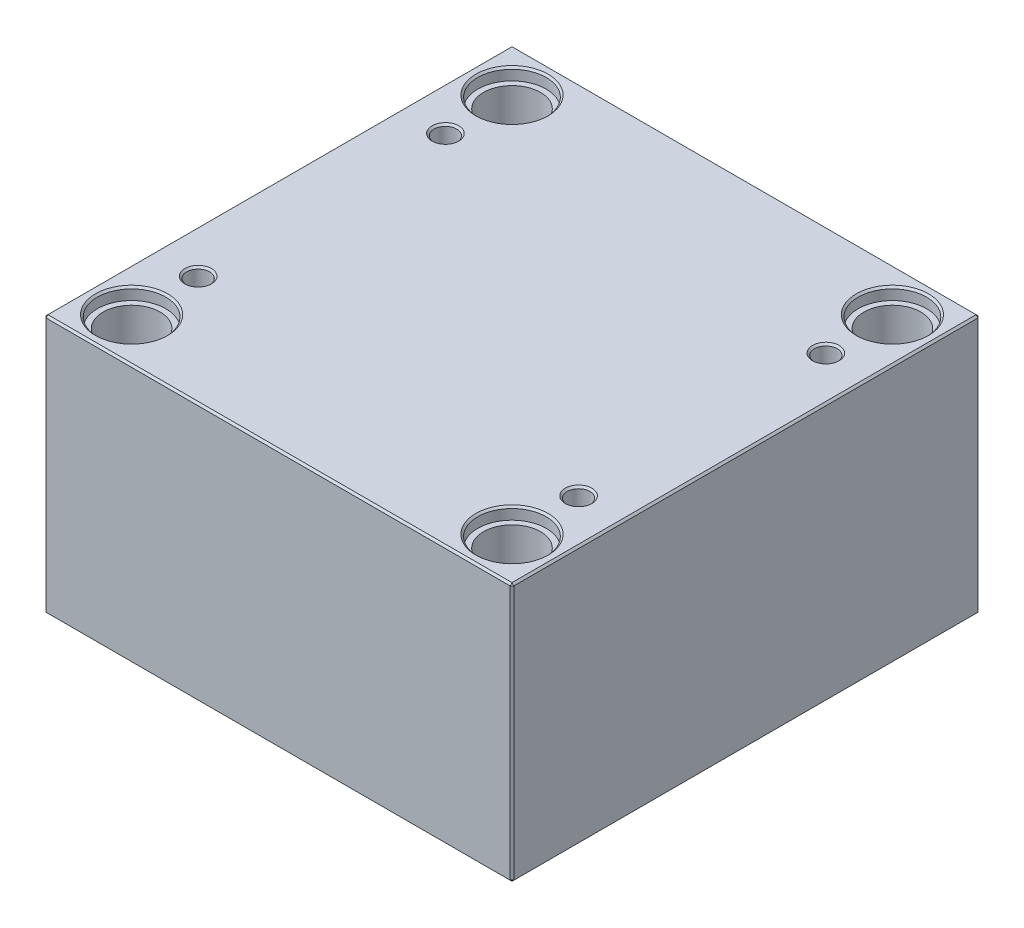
ISO-10303-21;
HEADER;
FILE_DESCRIPTION(('STEP AP214'),'2;1');
FILE_NAME('part.step','',(''),(''),'','','');
FILE_SCHEMA(('AUTOMOTIVE_DESIGN { 1 0 10303 214 1 1 1 1 }'));
ENDSEC;
DATA;
#1=APPLICATION_CONTEXT('core data for automotive mechanical design processes');
#2=APPLICATION_PROTOCOL_DEFINITION('international standard','automotive_design',2000,#1);
#3=PRODUCT_CONTEXT('',#1,'mechanical');
#4=PRODUCT('Part','Part','',(#3));
#5=PRODUCT_RELATED_PRODUCT_CATEGORY('part','',(#4));
#6=PRODUCT_DEFINITION_FORMATION('','',#4);
#7=PRODUCT_DEFINITION_CONTEXT('part definition',#1,'design');
#8=PRODUCT_DEFINITION('design','',#6,#7);
#9=PRODUCT_DEFINITION_SHAPE('','',#8);
#10=(LENGTH_UNIT() NAMED_UNIT(*) SI_UNIT(.MILLI.,.METRE.));
#11=(NAMED_UNIT(*) PLANE_ANGLE_UNIT() SI_UNIT($,.RADIAN.));
#12=(NAMED_UNIT(*) SI_UNIT($,.STERADIAN.) SOLID_ANGLE_UNIT());
#13=UNCERTAINTY_MEASURE_WITH_UNIT(LENGTH_MEASURE(1.E-05),#10,'distance_accuracy_value','');
#14=(GEOMETRIC_REPRESENTATION_CONTEXT(3) GLOBAL_UNCERTAINTY_ASSIGNED_CONTEXT((#13)) GLOBAL_UNIT_ASSIGNED_CONTEXT((#10,
#11,#12)) REPRESENTATION_CONTEXT('',''));
#15=CARTESIAN_POINT('',(0.,0.,0.));
#16=DIRECTION('',(0.,0.,1.));
#17=DIRECTION('',(1.,0.,0.));
#18=AXIS2_PLACEMENT_3D('',#15,#16,#17);
#19=CARTESIAN_POINT('',(-100.,0.,-100.));
#20=DIRECTION('',(0.,1.,0.));
#21=DIRECTION('',(0.,0.,1.));
#22=AXIS2_PLACEMENT_3D('',#19,#20,#21);
#23=CYLINDRICAL_SURFACE('',#22,15.);
#24=CARTESIAN_POINT('',(-100.,1.00000000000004,-100.));
#25=DIRECTION('',(0.,1.,0.));
#26=DIRECTION('',(0.,0.,1.));
#27=AXIS2_PLACEMENT_3D('',#24,#25,#26);
#28=CIRCLE('',#27,15.);
#29=CARTESIAN_POINT('',(-100.,1.00000000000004,-85.));
#30=VERTEX_POINT('',#29);
#31=EDGE_CURVE('E472',#30,#30,#28,.F.);
#32=ORIENTED_EDGE('',*,*,#31,.T.);
#33=EDGE_LOOP('',(#32));
#34=FACE_BOUND('',#33,.T.);
#35=CARTESIAN_POINT('',(-100.,129.7,-100.));
#36=DIRECTION('',(0.,1.,0.));
#37=DIRECTION('',(0.,0.,1.));
#38=AXIS2_PLACEMENT_3D('',#35,#36,#37);
#39=CIRCLE('',#38,15.);
#40=CARTESIAN_POINT('',(-100.,129.7,-85.));
#41=VERTEX_POINT('',#40);
#42=EDGE_CURVE('E221',#41,#41,#39,.F.);
#43=ORIENTED_EDGE('',*,*,#42,.F.);
#44=EDGE_LOOP('',(#43));
#45=FACE_BOUND('',#44,.T.);
#46=ADVANCED_FACE('F16',(#34,#45),#23,.F.);
#47=CARTESIAN_POINT('',(100.,0.,-100.));
#48=DIRECTION('',(0.,1.,0.));
#49=DIRECTION('',(0.,0.,1.));
#50=AXIS2_PLACEMENT_3D('',#47,#48,#49);
#51=CYLINDRICAL_SURFACE('',#50,15.);
#52=CARTESIAN_POINT('',(100.,1.00000000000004,-100.));
#53=DIRECTION('',(0.,1.,0.));
#54=DIRECTION('',(0.,0.,1.));
#55=AXIS2_PLACEMENT_3D('',#52,#53,#54);
#56=CIRCLE('',#55,15.);
#57=CARTESIAN_POINT('',(100.,1.00000000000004,-85.));
#58=VERTEX_POINT('',#57);
#59=EDGE_CURVE('E474',#58,#58,#56,.F.);
#60=ORIENTED_EDGE('',*,*,#59,.T.);
#61=EDGE_LOOP('',(#60));
#62=FACE_BOUND('',#61,.T.);
#63=CARTESIAN_POINT('',(100.,129.7,-100.));
#64=DIRECTION('',(0.,1.,0.));
#65=DIRECTION('',(0.,0.,1.));
#66=AXIS2_PLACEMENT_3D('',#63,#64,#65);
#67=CIRCLE('',#66,15.);
#68=CARTESIAN_POINT('',(100.,129.7,-85.));
#69=VERTEX_POINT('',#68);
#70=EDGE_CURVE('E218',#69,#69,#67,.F.);
#71=ORIENTED_EDGE('',*,*,#70,.F.);
#72=EDGE_LOOP('',(#71));
#73=FACE_BOUND('',#72,.T.);
#74=ADVANCED_FACE('F263',(#62,#73),#51,.F.);
#75=CARTESIAN_POINT('',(100.,0.,100.));
#76=DIRECTION('',(0.,1.,0.));
#77=DIRECTION('',(0.,0.,1.));
#78=AXIS2_PLACEMENT_3D('',#75,#76,#77);
#79=CYLINDRICAL_SURFACE('',#78,15.);
#80=CARTESIAN_POINT('',(100.,1.00000000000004,100.));
#81=DIRECTION('',(0.,1.,0.));
#82=DIRECTION('',(0.,0.,1.));
#83=AXIS2_PLACEMENT_3D('',#80,#81,#82);
#84=CIRCLE('',#83,15.);
#85=CARTESIAN_POINT('',(100.,1.00000000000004,115.));
#86=VERTEX_POINT('',#85);
#87=EDGE_CURVE('E477',#86,#86,#84,.F.);
#88=ORIENTED_EDGE('',*,*,#87,.T.);
#89=EDGE_LOOP('',(#88));
#90=FACE_BOUND('',#89,.T.);
#91=CARTESIAN_POINT('',(100.,129.7,100.));
#92=DIRECTION('',(0.,1.,0.));
#93=DIRECTION('',(0.,0.,1.));
#94=AXIS2_PLACEMENT_3D('',#91,#92,#93);
#95=CIRCLE('',#94,15.);
#96=CARTESIAN_POINT('',(100.,129.7,115.));
#97=VERTEX_POINT('',#96);
#98=EDGE_CURVE('E214',#97,#97,#95,.F.);
#99=ORIENTED_EDGE('',*,*,#98,.F.);
#100=EDGE_LOOP('',(#99));
#101=FACE_BOUND('',#100,.T.);
#102=ADVANCED_FACE('F270',(#90,#101),#79,.F.);
#103=CARTESIAN_POINT('',(-100.,0.,100.));
#104=DIRECTION('',(0.,1.,0.));
#105=DIRECTION('',(0.,0.,1.));
#106=AXIS2_PLACEMENT_3D('',#103,#104,#105);
#107=CYLINDRICAL_SURFACE('',#106,15.);
#108=CARTESIAN_POINT('',(-100.,1.00000000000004,100.));
#109=DIRECTION('',(0.,1.,0.));
#110=DIRECTION('',(0.,0.,1.));
#111=AXIS2_PLACEMENT_3D('',#108,#109,#110);
#112=CIRCLE('',#111,15.);
#113=CARTESIAN_POINT('',(-100.,1.00000000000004,115.));
#114=VERTEX_POINT('',#113);
#115=EDGE_CURVE('E480',#114,#114,#112,.F.);
#116=ORIENTED_EDGE('',*,*,#115,.T.);
#117=EDGE_LOOP('',(#116));
#118=FACE_BOUND('',#117,.T.);
#119=CARTESIAN_POINT('',(-100.,129.7,100.));
#120=DIRECTION('',(0.,1.,0.));
#121=DIRECTION('',(0.,0.,1.));
#122=AXIS2_PLACEMENT_3D('',#119,#120,#121);
#123=CIRCLE('',#122,15.);
#124=CARTESIAN_POINT('',(-100.,129.7,115.));
#125=VERTEX_POINT('',#124);
#126=EDGE_CURVE('E211',#125,#125,#123,.F.);
#127=ORIENTED_EDGE('',*,*,#126,.F.);
#128=EDGE_LOOP('',(#127));
#129=FACE_BOUND('',#128,.T.);
#130=ADVANCED_FACE('F277',(#118,#129),#107,.F.);
#131=CARTESIAN_POINT('',(-123.,136.,123.));
#132=DIRECTION('',(1.,0.,0.));
#133=DIRECTION('',(0.,0.,-1.));
#134=AXIS2_PLACEMENT_3D('',#131,#132,#133);
#135=PLANE('',#134);
#136=DIRECTION('',(0.,-1.,0.));
#137=VECTOR('',#136,1.);
#138=CARTESIAN_POINT('',(-123.,136.,-122.));
#139=LINE('',#138,#137);
#140=CARTESIAN_POINT('',(-123.,135.,-122.));
#141=VERTEX_POINT('',#140);
#142=CARTESIAN_POINT('',(-123.,1.,-122.));
#143=VERTEX_POINT('',#142);
#144=EDGE_CURVE('E487',#141,#143,#139,.T.);
#145=ORIENTED_EDGE('',*,*,#144,.T.);
#146=DIRECTION('',(0.,0.,1.));
#147=VECTOR('',#146,1.);
#148=CARTESIAN_POINT('',(-123.,1.,123.));
#149=LINE('',#148,#147);
#150=CARTESIAN_POINT('',(-123.,1.,122.));
#151=VERTEX_POINT('',#150);
#152=EDGE_CURVE('E490',#143,#151,#149,.T.);
#153=ORIENTED_EDGE('',*,*,#152,.T.);
#154=DIRECTION('',(0.,1.,0.));
#155=VECTOR('',#154,1.);
#156=CARTESIAN_POINT('',(-123.,136.,122.));
#157=LINE('',#156,#155);
#158=CARTESIAN_POINT('',(-123.,135.,122.));
#159=VERTEX_POINT('',#158);
#160=EDGE_CURVE('E485',#151,#159,#157,.T.);
#161=ORIENTED_EDGE('',*,*,#160,.T.);
#162=DIRECTION('',(0.,0.,-1.));
#163=VECTOR('',#162,1.);
#164=CARTESIAN_POINT('',(-123.,135.,-123.));
#165=LINE('',#164,#163);
#166=EDGE_CURVE('E483',#159,#141,#165,.T.);
#167=ORIENTED_EDGE('',*,*,#166,.T.);
#168=EDGE_LOOP('',(#145,#153,#161,#167));
#169=FACE_BOUND('',#168,.T.);
#170=ADVANCED_FACE('F298',(#169),#135,.F.);
#171=CARTESIAN_POINT('',(123.,136.,123.));
#172=DIRECTION('',(0.,0.,-1.));
#173=DIRECTION('',(-1.,0.,0.));
#174=AXIS2_PLACEMENT_3D('',#171,#172,#173);
#175=PLANE('',#174);
#176=DIRECTION('',(-1.,0.,0.));
#177=VECTOR('',#176,1.);
#178=CARTESIAN_POINT('',(-123.,135.,123.));
#179=LINE('',#178,#177);
#180=CARTESIAN_POINT('',(122.,135.,123.));
#181=VERTEX_POINT('',#180);
#182=CARTESIAN_POINT('',(-122.,135.,123.));
#183=VERTEX_POINT('',#182);
#184=EDGE_CURVE('E509',#181,#183,#179,.T.);
#185=ORIENTED_EDGE('',*,*,#184,.T.);
#186=DIRECTION('',(0.,-1.,0.));
#187=VECTOR('',#186,1.);
#188=CARTESIAN_POINT('',(-122.,136.,123.));
#189=LINE('',#188,#187);
#190=CARTESIAN_POINT('',(-122.,0.999999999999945,123.));
#191=VERTEX_POINT('',#190);
#192=EDGE_CURVE('E515',#183,#191,#189,.T.);
#193=ORIENTED_EDGE('',*,*,#192,.T.);
#194=DIRECTION('',(1.,0.,0.));
#195=VECTOR('',#194,1.);
#196=CARTESIAN_POINT('',(123.,0.999999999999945,123.));
#197=LINE('',#196,#195);
#198=CARTESIAN_POINT('',(122.,0.999999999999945,123.));
#199=VERTEX_POINT('',#198);
#200=EDGE_CURVE('E513',#191,#199,#197,.T.);
#201=ORIENTED_EDGE('',*,*,#200,.T.);
#202=DIRECTION('',(0.,1.,0.));
#203=VECTOR('',#202,1.);
#204=CARTESIAN_POINT('',(122.,136.,123.));
#205=LINE('',#204,#203);
#206=EDGE_CURVE('E511',#199,#181,#205,.T.);
#207=ORIENTED_EDGE('',*,*,#206,.T.);
#208=EDGE_LOOP('',(#185,#193,#201,#207));
#209=FACE_BOUND('',#208,.T.);
#210=ADVANCED_FACE('F294',(#209),#175,.F.);
#211=CARTESIAN_POINT('',(123.,136.,123.));
#212=DIRECTION('',(-1.,0.,0.));
#213=DIRECTION('',(0.,0.,1.));
#214=AXIS2_PLACEMENT_3D('',#211,#212,#213);
#215=PLANE('',#214);
#216=DIRECTION('',(0.,0.,-1.));
#217=VECTOR('',#216,1.);
#218=CARTESIAN_POINT('',(123.,0.999999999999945,123.));
#219=LINE('',#218,#217);
#220=CARTESIAN_POINT('',(123.,0.999999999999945,122.));
#221=VERTEX_POINT('',#220);
#222=CARTESIAN_POINT('',(123.,0.999999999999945,-122.));
#223=VERTEX_POINT('',#222);
#224=EDGE_CURVE('E504',#221,#223,#219,.T.);
#225=ORIENTED_EDGE('',*,*,#224,.T.);
#226=DIRECTION('',(0.,1.,0.));
#227=VECTOR('',#226,1.);
#228=CARTESIAN_POINT('',(123.,136.,-122.));
#229=LINE('',#228,#227);
#230=CARTESIAN_POINT('',(123.,135.,-122.));
#231=VERTEX_POINT('',#230);
#232=EDGE_CURVE('E506',#223,#231,#229,.T.);
#233=ORIENTED_EDGE('',*,*,#232,.T.);
#234=DIRECTION('',(0.,0.,1.));
#235=VECTOR('',#234,1.);
#236=CARTESIAN_POINT('',(123.,135.,123.));
#237=LINE('',#236,#235);
#238=CARTESIAN_POINT('',(123.,135.,122.));
#239=VERTEX_POINT('',#238);
#240=EDGE_CURVE('E500',#231,#239,#237,.T.);
#241=ORIENTED_EDGE('',*,*,#240,.T.);
#242=DIRECTION('',(0.,-1.,0.));
#243=VECTOR('',#242,1.);
#244=CARTESIAN_POINT('',(123.,136.,122.));
#245=LINE('',#244,#243);
#246=EDGE_CURVE('E502',#239,#221,#245,.T.);
#247=ORIENTED_EDGE('',*,*,#246,.T.);
#248=EDGE_LOOP('',(#225,#233,#241,#247));
#249=FACE_BOUND('',#248,.T.);
#250=ADVANCED_FACE('F290',(#249),#215,.F.);
#251=CARTESIAN_POINT('',(123.,136.,-123.));
#252=DIRECTION('',(0.,0.,1.));
#253=DIRECTION('',(1.,0.,0.));
#254=AXIS2_PLACEMENT_3D('',#251,#252,#253);
#255=PLANE('',#254);
#256=DIRECTION('',(0.,-1.,0.));
#257=VECTOR('',#256,1.);
#258=CARTESIAN_POINT('',(122.,136.,-123.));
#259=LINE('',#258,#257);
#260=CARTESIAN_POINT('',(122.,135.,-123.));
#261=VERTEX_POINT('',#260);
#262=CARTESIAN_POINT('',(122.,0.999999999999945,-123.));
#263=VERTEX_POINT('',#262);
#264=EDGE_CURVE('E494',#261,#263,#259,.T.);
#265=ORIENTED_EDGE('',*,*,#264,.T.);
#266=DIRECTION('',(-1.,0.,0.));
#267=VECTOR('',#266,1.);
#268=CARTESIAN_POINT('',(123.,0.999999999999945,-123.));
#269=LINE('',#268,#267);
#270=CARTESIAN_POINT('',(-122.,0.999999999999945,-123.));
#271=VERTEX_POINT('',#270);
#272=EDGE_CURVE('E138',#263,#271,#269,.T.);
#273=ORIENTED_EDGE('',*,*,#272,.T.);
#274=DIRECTION('',(0.,1.,0.));
#275=VECTOR('',#274,1.);
#276=CARTESIAN_POINT('',(-122.,136.,-123.));
#277=LINE('',#276,#275);
#278=CARTESIAN_POINT('',(-122.,135.,-123.));
#279=VERTEX_POINT('',#278);
#280=EDGE_CURVE('E496',#271,#279,#277,.T.);
#281=ORIENTED_EDGE('',*,*,#280,.T.);
#282=DIRECTION('',(1.,0.,0.));
#283=VECTOR('',#282,1.);
#284=CARTESIAN_POINT('',(123.,135.,-123.));
#285=LINE('',#284,#283);
#286=EDGE_CURVE('E492',#279,#261,#285,.T.);
#287=ORIENTED_EDGE('',*,*,#286,.T.);
#288=EDGE_LOOP('',(#265,#273,#281,#287));
#289=FACE_BOUND('',#288,.T.);
#290=ADVANCED_FACE('F282',(#289),#255,.F.);
#291=CARTESIAN_POINT('',(0.,136.,0.));
#292=DIRECTION('',(0.,1.,0.));
#293=DIRECTION('',(0.,0.,1.));
#294=AXIS2_PLACEMENT_3D('',#291,#292,#293);
#295=PLANE('',#294);
#296=CARTESIAN_POINT('',(100.,136.,100.));
#297=DIRECTION('',(0.,1.,0.));
#298=DIRECTION('',(0.,0.,1.));
#299=AXIS2_PLACEMENT_3D('',#296,#297,#298);
#300=CIRCLE('',#299,19.);
#301=CARTESIAN_POINT('',(100.,136.,119.));
#302=VERTEX_POINT('',#301);
#303=EDGE_CURVE('E236',#302,#302,#300,.F.);
#304=ORIENTED_EDGE('',*,*,#303,.T.);
#305=EDGE_LOOP('',(#304));
#306=FACE_BOUND('',#305,.T.);
#307=CARTESIAN_POINT('',(-100.,136.,100.));
#308=DIRECTION('',(0.,1.,0.));
#309=DIRECTION('',(0.,0.,1.));
#310=AXIS2_PLACEMENT_3D('',#307,#308,#309);
#311=CIRCLE('',#310,19.);
#312=CARTESIAN_POINT('',(-100.,136.,119.));
#313=VERTEX_POINT('',#312);
#314=EDGE_CURVE('E233',#313,#313,#311,.F.);
#315=ORIENTED_EDGE('',*,*,#314,.T.);
#316=EDGE_LOOP('',(#315));
#317=FACE_BOUND('',#316,.T.);
#318=CARTESIAN_POINT('',(100.,136.,-100.));
#319=DIRECTION('',(0.,1.,0.));
#320=DIRECTION('',(0.,0.,1.));
#321=AXIS2_PLACEMENT_3D('',#318,#319,#320);
#322=CIRCLE('',#321,19.);
#323=CARTESIAN_POINT('',(100.,136.,-81.));
#324=VERTEX_POINT('',#323);
#325=EDGE_CURVE('E230',#324,#324,#322,.F.);
#326=ORIENTED_EDGE('',*,*,#325,.T.);
#327=EDGE_LOOP('',(#326));
#328=FACE_BOUND('',#327,.T.);
#329=CARTESIAN_POINT('',(-100.,136.,-100.));
#330=DIRECTION('',(0.,1.,0.));
#331=DIRECTION('',(0.,0.,1.));
#332=AXIS2_PLACEMENT_3D('',#329,#330,#331);
#333=CIRCLE('',#332,19.);
#334=CARTESIAN_POINT('',(-100.,136.,-81.));
#335=VERTEX_POINT('',#334);
#336=EDGE_CURVE('E227',#335,#335,#333,.F.);
#337=ORIENTED_EDGE('',*,*,#336,.T.);
#338=EDGE_LOOP('',(#337));
#339=FACE_BOUND('',#338,.T.);
#340=CARTESIAN_POINT('',(-100.,136.,65.));
#341=DIRECTION('',(0.,1.,0.));
#342=DIRECTION('',(0.,0.,1.));
#343=AXIS2_PLACEMENT_3D('',#340,#341,#342);
#344=CIRCLE('',#343,7.);
#345=CARTESIAN_POINT('',(-100.,136.,72.));
#346=VERTEX_POINT('',#345);
#347=EDGE_CURVE('E198',#346,#346,#344,.F.);
#348=ORIENTED_EDGE('',*,*,#347,.T.);
#349=EDGE_LOOP('',(#348));
#350=FACE_BOUND('',#349,.T.);
#351=CARTESIAN_POINT('',(100.,136.,65.));
#352=DIRECTION('',(0.,1.,0.));
#353=DIRECTION('',(0.,0.,1.));
#354=AXIS2_PLACEMENT_3D('',#351,#352,#353);
#355=CIRCLE('',#354,7.);
#356=CARTESIAN_POINT('',(100.,136.,72.));
#357=VERTEX_POINT('',#356);
#358=EDGE_CURVE('E195',#357,#357,#355,.F.);
#359=ORIENTED_EDGE('',*,*,#358,.T.);
#360=EDGE_LOOP('',(#359));
#361=FACE_BOUND('',#360,.T.);
#362=CARTESIAN_POINT('',(100.,136.,-65.));
#363=DIRECTION('',(0.,1.,0.));
#364=DIRECTION('',(0.,0.,1.));
#365=AXIS2_PLACEMENT_3D('',#362,#363,#364);
#366=CIRCLE('',#365,7.);
#367=CARTESIAN_POINT('',(100.,136.,-58.));
#368=VERTEX_POINT('',#367);
#369=EDGE_CURVE('E192',#368,#368,#366,.F.);
#370=ORIENTED_EDGE('',*,*,#369,.T.);
#371=EDGE_LOOP('',(#370));
#372=FACE_BOUND('',#371,.T.);
#373=CARTESIAN_POINT('',(-100.,136.,-65.));
#374=DIRECTION('',(0.,1.,0.));
#375=DIRECTION('',(0.,0.,1.));
#376=AXIS2_PLACEMENT_3D('',#373,#374,#375);
#377=CIRCLE('',#376,7.);
#378=CARTESIAN_POINT('',(-100.,136.,-58.));
#379=VERTEX_POINT('',#378);
#380=EDGE_CURVE('E188',#379,#379,#377,.F.);
#381=ORIENTED_EDGE('',*,*,#380,.T.);
#382=EDGE_LOOP('',(#381));
#383=FACE_BOUND('',#382,.T.);
#384=DIRECTION('',(0.,0.,-1.));
#385=VECTOR('',#384,1.);
#386=CARTESIAN_POINT('',(122.,136.,-123.));
#387=LINE('',#386,#385);
#388=CARTESIAN_POINT('',(122.,136.,122.));
#389=VERTEX_POINT('',#388);
#390=CARTESIAN_POINT('',(122.,136.,-122.));
#391=VERTEX_POINT('',#390);
#392=EDGE_CURVE('E31',#389,#391,#387,.T.);
#393=ORIENTED_EDGE('',*,*,#392,.T.);
#394=DIRECTION('',(-1.,0.,0.));
#395=VECTOR('',#394,1.);
#396=CARTESIAN_POINT('',(-123.,136.,-122.));
#397=LINE('',#396,#395);
#398=CARTESIAN_POINT('',(-122.,136.,-122.));
#399=VERTEX_POINT('',#398);
#400=EDGE_CURVE('E189',#391,#399,#397,.T.);
#401=ORIENTED_EDGE('',*,*,#400,.T.);
#402=DIRECTION('',(0.,0.,1.));
#403=VECTOR('',#402,1.);
#404=CARTESIAN_POINT('',(-122.,136.,123.));
#405=LINE('',#404,#403);
#406=CARTESIAN_POINT('',(-122.,136.,122.));
#407=VERTEX_POINT('',#406);
#408=EDGE_CURVE('E518',#399,#407,#405,.T.);
#409=ORIENTED_EDGE('',*,*,#408,.T.);
#410=DIRECTION('',(1.,0.,0.));
#411=VECTOR('',#410,1.);
#412=CARTESIAN_POINT('',(123.,136.,122.));
#413=LINE('',#412,#411);
#414=EDGE_CURVE('E36',#407,#389,#413,.T.);
#415=ORIENTED_EDGE('',*,*,#414,.T.);
#416=EDGE_LOOP('',(#393,#401,#409,#415));
#417=FACE_BOUND('',#416,.T.);
#418=ADVANCED_FACE('F279',(#306,#317,#328,#339,#350,#361,#372,#383,#417),#295,.T.);
#419=CARTESIAN_POINT('',(0.,0.,0.));
#420=DIRECTION('',(0.,1.,0.));
#421=DIRECTION('',(0.,0.,1.));
#422=AXIS2_PLACEMENT_3D('',#419,#420,#421);
#423=PLANE('',#422);
#424=CARTESIAN_POINT('',(-100.,0.,-100.));
#425=DIRECTION('',(0.,1.,0.));
#426=DIRECTION('',(0.,0.,1.));
#427=AXIS2_PLACEMENT_3D('',#424,#425,#426);
#428=CIRCLE('',#427,16.);
#429=CARTESIAN_POINT('',(-100.,0.,-84.));
#430=VERTEX_POINT('',#429);
#431=EDGE_CURVE('E469',#430,#430,#428,.T.);
#432=ORIENTED_EDGE('',*,*,#431,.T.);
#433=EDGE_LOOP('',(#432));
#434=FACE_BOUND('',#433,.T.);
#435=CARTESIAN_POINT('',(100.,0.,-100.));
#436=DIRECTION('',(0.,1.,0.));
#437=DIRECTION('',(0.,0.,1.));
#438=AXIS2_PLACEMENT_3D('',#435,#436,#437);
#439=CIRCLE('',#438,16.);
#440=CARTESIAN_POINT('',(100.,0.,-84.));
#441=VERTEX_POINT('',#440);
#442=EDGE_CURVE('E466',#441,#441,#439,.T.);
#443=ORIENTED_EDGE('',*,*,#442,.T.);
#444=EDGE_LOOP('',(#443));
#445=FACE_BOUND('',#444,.T.);
#446=CARTESIAN_POINT('',(100.,0.,100.));
#447=DIRECTION('',(0.,1.,0.));
#448=DIRECTION('',(0.,0.,1.));
#449=AXIS2_PLACEMENT_3D('',#446,#447,#448);
#450=CIRCLE('',#449,16.);
#451=CARTESIAN_POINT('',(100.,0.,116.));
#452=VERTEX_POINT('',#451);
#453=EDGE_CURVE('E463',#452,#452,#450,.T.);
#454=ORIENTED_EDGE('',*,*,#453,.T.);
#455=EDGE_LOOP('',(#454));
#456=FACE_BOUND('',#455,.T.);
#457=CARTESIAN_POINT('',(-100.,0.,100.));
#458=DIRECTION('',(0.,1.,0.));
#459=DIRECTION('',(0.,0.,1.));
#460=AXIS2_PLACEMENT_3D('',#457,#458,#459);
#461=CIRCLE('',#460,16.);
#462=CARTESIAN_POINT('',(-100.,0.,116.));
#463=VERTEX_POINT('',#462);
#464=EDGE_CURVE('E460',#463,#463,#461,.T.);
#465=ORIENTED_EDGE('',*,*,#464,.T.);
#466=EDGE_LOOP('',(#465));
#467=FACE_BOUND('',#466,.T.);
#468=DIRECTION('',(0.,0.,1.));
#469=VECTOR('',#468,1.);
#470=CARTESIAN_POINT('',(122.,0.,0.));
#471=LINE('',#470,#469);
#472=CARTESIAN_POINT('',(122.,0.,-122.));
#473=VERTEX_POINT('',#472);
#474=CARTESIAN_POINT('',(122.,0.,122.));
#475=VERTEX_POINT('',#474);
#476=EDGE_CURVE('E108',#473,#475,#471,.T.);
#477=ORIENTED_EDGE('',*,*,#476,.T.);
#478=DIRECTION('',(-1.,0.,0.));
#479=VECTOR('',#478,1.);
#480=CARTESIAN_POINT('',(0.,0.,122.));
#481=LINE('',#480,#479);
#482=CARTESIAN_POINT('',(-122.,0.,122.));
#483=VERTEX_POINT('',#482);
#484=EDGE_CURVE('E458',#475,#483,#481,.T.);
#485=ORIENTED_EDGE('',*,*,#484,.T.);
#486=DIRECTION('',(0.,0.,-1.));
#487=VECTOR('',#486,1.);
#488=CARTESIAN_POINT('',(-122.,0.,0.));
#489=LINE('',#488,#487);
#490=CARTESIAN_POINT('',(-122.,0.,-122.));
#491=VERTEX_POINT('',#490);
#492=EDGE_CURVE('E110',#483,#491,#489,.T.);
#493=ORIENTED_EDGE('',*,*,#492,.T.);
#494=DIRECTION('',(1.,0.,0.));
#495=VECTOR('',#494,1.);
#496=CARTESIAN_POINT('',(0.,0.,-122.));
#497=LINE('',#496,#495);
#498=EDGE_CURVE('E104',#491,#473,#497,.T.);
#499=ORIENTED_EDGE('',*,*,#498,.T.);
#500=EDGE_LOOP('',(#477,#485,#493,#499));
#501=FACE_BOUND('',#500,.T.);
#502=ADVANCED_FACE('F106',(#434,#445,#456,#467,#501),#423,.F.);
#503=CARTESIAN_POINT('',(-100.,0.,-100.));
#504=DIRECTION('',(0.,-1.,0.));
#505=DIRECTION('',(0.,0.,-1.));
#506=AXIS2_PLACEMENT_3D('',#503,#504,#505);
#507=CONICAL_SURFACE('',#506,16.,0.785398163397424);
#508=ORIENTED_EDGE('',*,*,#31,.F.);
#509=EDGE_LOOP('',(#508));
#510=FACE_BOUND('',#509,.T.);
#511=ORIENTED_EDGE('',*,*,#431,.F.);
#512=EDGE_LOOP('',(#511));
#513=FACE_BOUND('',#512,.T.);
#514=ADVANCED_FACE('F286',(#510,#513),#507,.F.);
#515=CARTESIAN_POINT('',(100.,0.,-100.));
#516=DIRECTION('',(0.,-1.,0.));
#517=DIRECTION('',(0.,0.,-1.));
#518=AXIS2_PLACEMENT_3D('',#515,#516,#517);
#519=CONICAL_SURFACE('',#518,16.,0.785398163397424);
#520=ORIENTED_EDGE('',*,*,#59,.F.);
#521=EDGE_LOOP('',(#520));
#522=FACE_BOUND('',#521,.T.);
#523=ORIENTED_EDGE('',*,*,#442,.F.);
#524=EDGE_LOOP('',(#523));
#525=FACE_BOUND('',#524,.T.);
#526=ADVANCED_FACE('F305',(#522,#525),#519,.F.);
#527=CARTESIAN_POINT('',(100.,0.,100.));
#528=DIRECTION('',(0.,-1.,0.));
#529=DIRECTION('',(0.,0.,-1.));
#530=AXIS2_PLACEMENT_3D('',#527,#528,#529);
#531=CONICAL_SURFACE('',#530,16.,0.785398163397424);
#532=ORIENTED_EDGE('',*,*,#87,.F.);
#533=EDGE_LOOP('',(#532));
#534=FACE_BOUND('',#533,.T.);
#535=ORIENTED_EDGE('',*,*,#453,.F.);
#536=EDGE_LOOP('',(#535));
#537=FACE_BOUND('',#536,.T.);
#538=ADVANCED_FACE('F309',(#534,#537),#531,.F.);
#539=CARTESIAN_POINT('',(-100.,0.,100.));
#540=DIRECTION('',(0.,-1.,0.));
#541=DIRECTION('',(0.,0.,-1.));
#542=AXIS2_PLACEMENT_3D('',#539,#540,#541);
#543=CONICAL_SURFACE('',#542,16.,0.785398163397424);
#544=ORIENTED_EDGE('',*,*,#115,.F.);
#545=EDGE_LOOP('',(#544));
#546=FACE_BOUND('',#545,.T.);
#547=ORIENTED_EDGE('',*,*,#464,.F.);
#548=EDGE_LOOP('',(#547));
#549=FACE_BOUND('',#548,.T.);
#550=ADVANCED_FACE('F313',(#546,#549),#543,.F.);
#551=CARTESIAN_POINT('',(123.,136.,122.));
#552=DIRECTION('',(-0.707106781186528,0.,-0.707106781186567));
#553=DIRECTION('',(0.,-1.,0.));
#554=AXIS2_PLACEMENT_3D('',#551,#552,#553);
#555=PLANE('',#554);
#556=DIRECTION('',(-0.707106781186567,0.,0.707106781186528));
#557=VECTOR('',#556,1.);
#558=CARTESIAN_POINT('',(122.,135.,123.));
#559=LINE('',#558,#557);
#560=EDGE_CURVE('E126',#181,#239,#559,.F.);
#561=ORIENTED_EDGE('',*,*,#560,.F.);
#562=ORIENTED_EDGE('',*,*,#206,.F.);
#563=DIRECTION('',(0.707106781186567,0.,-0.707106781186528));
#564=VECTOR('',#563,1.);
#565=CARTESIAN_POINT('',(122.,0.999999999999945,123.));
#566=LINE('',#565,#564);
#567=EDGE_CURVE('E180',#221,#199,#566,.F.);
#568=ORIENTED_EDGE('',*,*,#567,.F.);
#569=ORIENTED_EDGE('',*,*,#246,.F.);
#570=EDGE_LOOP('',(#561,#562,#568,#569));
#571=FACE_BOUND('',#570,.T.);
#572=ADVANCED_FACE('F317',(#571),#555,.F.);
#573=CARTESIAN_POINT('',(122.,135.,123.));
#574=DIRECTION('',(0.577350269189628,0.577350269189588,0.577350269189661));
#575=DIRECTION('',(0.707106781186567,0.,-0.707106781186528));
#576=AXIS2_PLACEMENT_3D('',#573,#574,#575);
#577=PLANE('',#576);
#578=DIRECTION('',(0.,-0.70710678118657,0.707106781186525));
#579=VECTOR('',#578,1.);
#580=CARTESIAN_POINT('',(122.,135.,123.));
#581=LINE('',#580,#579);
#582=EDGE_CURVE('E175',#181,#389,#581,.F.);
#583=ORIENTED_EDGE('',*,*,#582,.F.);
#584=ORIENTED_EDGE('',*,*,#560,.T.);
#585=DIRECTION('',(-0.707106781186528,0.707106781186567,0.));
#586=VECTOR('',#585,1.);
#587=CARTESIAN_POINT('',(122.5,135.5,122.));
#588=LINE('',#587,#586);
#589=EDGE_CURVE('E177',#389,#239,#588,.F.);
#590=ORIENTED_EDGE('',*,*,#589,.F.);
#591=EDGE_LOOP('',(#583,#584,#590));
#592=FACE_BOUND('',#591,.T.);
#593=ADVANCED_FACE('F385',(#592),#577,.T.);
#594=CARTESIAN_POINT('',(122.,0.999999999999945,123.));
#595=DIRECTION('',(0.577350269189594,-0.577350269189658,0.577350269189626));
#596=DIRECTION('',(0.,-0.707106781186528,-0.707106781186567));
#597=AXIS2_PLACEMENT_3D('',#594,#595,#596);
#598=PLANE('',#597);
#599=DIRECTION('',(-0.707106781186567,-0.707106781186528,0.));
#600=VECTOR('',#599,1.);
#601=CARTESIAN_POINT('',(122.5,0.499999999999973,122.));
#602=LINE('',#601,#600);
#603=EDGE_CURVE('E124',#221,#475,#602,.T.);
#604=ORIENTED_EDGE('',*,*,#603,.F.);
#605=ORIENTED_EDGE('',*,*,#567,.T.);
#606=DIRECTION('',(0.,0.70710678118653,0.707106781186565));
#607=VECTOR('',#606,1.);
#608=CARTESIAN_POINT('',(122.,0.999999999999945,123.));
#609=LINE('',#608,#607);
#610=EDGE_CURVE('E172',#475,#199,#609,.T.);
#611=ORIENTED_EDGE('',*,*,#610,.F.);
#612=EDGE_LOOP('',(#604,#605,#611));
#613=FACE_BOUND('',#612,.T.);
#614=ADVANCED_FACE('F381',(#613),#598,.T.);
#615=CARTESIAN_POINT('',(122.,136.,0.));
#616=DIRECTION('',(0.707106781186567,0.707106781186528,0.));
#617=DIRECTION('',(0.,0.,1.));
#618=AXIS2_PLACEMENT_3D('',#615,#616,#617);
#619=PLANE('',#618);
#620=ORIENTED_EDGE('',*,*,#589,.T.);
#621=ORIENTED_EDGE('',*,*,#240,.F.);
#622=DIRECTION('',(0.707106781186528,-0.707106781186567,0.));
#623=VECTOR('',#622,1.);
#624=CARTESIAN_POINT('',(123.,135.,-122.));
#625=LINE('',#624,#623);
#626=EDGE_CURVE('E166',#391,#231,#625,.T.);
#627=ORIENTED_EDGE('',*,*,#626,.F.);
#628=ORIENTED_EDGE('',*,*,#392,.F.);
#629=EDGE_LOOP('',(#620,#621,#627,#628));
#630=FACE_BOUND('',#629,.T.);
#631=ADVANCED_FACE('F377',(#630),#619,.T.);
#632=CARTESIAN_POINT('',(0.,136.,122.));
#633=DIRECTION('',(0.,0.707106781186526,0.70710678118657));
#634=DIRECTION('',(-1.,0.,0.));
#635=AXIS2_PLACEMENT_3D('',#632,#633,#634);
#636=PLANE('',#635);
#637=ORIENTED_EDGE('',*,*,#582,.T.);
#638=ORIENTED_EDGE('',*,*,#414,.F.);
#639=DIRECTION('',(0.,0.70710678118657,-0.707106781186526));
#640=VECTOR('',#639,1.);
#641=CARTESIAN_POINT('',(-122.,135.5,122.5));
#642=LINE('',#641,#640);
#643=EDGE_CURVE('E163',#183,#407,#642,.T.);
#644=ORIENTED_EDGE('',*,*,#643,.F.);
#645=ORIENTED_EDGE('',*,*,#184,.F.);
#646=EDGE_LOOP('',(#637,#638,#644,#645));
#647=FACE_BOUND('',#646,.T.);
#648=ADVANCED_FACE('F373',(#647),#636,.T.);
#649=CARTESIAN_POINT('',(-122.,136.,123.));
#650=DIRECTION('',(0.707106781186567,0.,-0.707106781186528));
#651=DIRECTION('',(0.,-1.,0.));
#652=AXIS2_PLACEMENT_3D('',#649,#650,#651);
#653=PLANE('',#652);
#654=DIRECTION('',(0.707106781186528,0.,0.707106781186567));
#655=VECTOR('',#654,1.);
#656=CARTESIAN_POINT('',(-122.,0.999999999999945,123.));
#657=LINE('',#656,#655);
#658=EDGE_CURVE('E157',#191,#151,#657,.F.);
#659=ORIENTED_EDGE('',*,*,#658,.F.);
#660=ORIENTED_EDGE('',*,*,#192,.F.);
#661=DIRECTION('',(-0.707106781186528,0.,-0.707106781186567));
#662=VECTOR('',#661,1.);
#663=CARTESIAN_POINT('',(-123.,135.,122.));
#664=LINE('',#663,#662);
#665=EDGE_CURVE('E160',#159,#183,#664,.F.);
#666=ORIENTED_EDGE('',*,*,#665,.F.);
#667=ORIENTED_EDGE('',*,*,#160,.F.);
#668=EDGE_LOOP('',(#659,#660,#666,#667));
#669=FACE_BOUND('',#668,.T.);
#670=ADVANCED_FACE('F369',(#669),#653,.F.);
#671=CARTESIAN_POINT('',(123.,0.999999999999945,123.));
#672=DIRECTION('',(0.,0.707106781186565,-0.70710678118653));
#673=DIRECTION('',(1.,0.,0.));
#674=AXIS2_PLACEMENT_3D('',#671,#672,#673);
#675=PLANE('',#674);
#676=ORIENTED_EDGE('',*,*,#610,.T.);
#677=ORIENTED_EDGE('',*,*,#200,.F.);
#678=DIRECTION('',(0.,-0.70710678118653,-0.707106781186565));
#679=VECTOR('',#678,1.);
#680=CARTESIAN_POINT('',(-122.,0.999999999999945,123.));
#681=LINE('',#680,#679);
#682=EDGE_CURVE('E135',#483,#191,#681,.F.);
#683=ORIENTED_EDGE('',*,*,#682,.F.);
#684=ORIENTED_EDGE('',*,*,#484,.F.);
#685=EDGE_LOOP('',(#676,#677,#683,#684));
#686=FACE_BOUND('',#685,.T.);
#687=ADVANCED_FACE('F366',(#686),#675,.F.);
#688=CARTESIAN_POINT('',(123.,0.999999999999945,123.));
#689=DIRECTION('',(-0.707106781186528,0.707106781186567,0.));
#690=DIRECTION('',(0.,0.,-1.));
#691=AXIS2_PLACEMENT_3D('',#688,#689,#690);
#692=PLANE('',#691);
#693=ORIENTED_EDGE('',*,*,#603,.T.);
#694=ORIENTED_EDGE('',*,*,#476,.F.);
#695=DIRECTION('',(0.707106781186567,0.707106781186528,0.));
#696=VECTOR('',#695,1.);
#697=CARTESIAN_POINT('',(122.5,0.499999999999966,-122.));
#698=LINE('',#697,#696);
#699=EDGE_CURVE('E121',#223,#473,#698,.F.);
#700=ORIENTED_EDGE('',*,*,#699,.F.);
#701=ORIENTED_EDGE('',*,*,#224,.F.);
#702=EDGE_LOOP('',(#693,#694,#700,#701));
#703=FACE_BOUND('',#702,.T.);
#704=ADVANCED_FACE('F119',(#703),#692,.F.);
#705=CARTESIAN_POINT('',(122.,136.,-123.));
#706=DIRECTION('',(-0.707106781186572,0.,0.707106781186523));
#707=DIRECTION('',(0.,-1.,0.));
#708=AXIS2_PLACEMENT_3D('',#705,#706,#707);
#709=PLANE('',#708);
#710=DIRECTION('',(0.707106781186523,0.,0.707106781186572));
#711=VECTOR('',#710,1.);
#712=CARTESIAN_POINT('',(123.,135.,-122.));
#713=LINE('',#712,#711);
#714=EDGE_CURVE('E168',#231,#261,#713,.F.);
#715=ORIENTED_EDGE('',*,*,#714,.F.);
#716=ORIENTED_EDGE('',*,*,#232,.F.);
#717=DIRECTION('',(-0.707106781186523,0.,-0.707106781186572));
#718=VECTOR('',#717,1.);
#719=CARTESIAN_POINT('',(122.,0.999999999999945,-123.));
#720=LINE('',#719,#718);
#721=EDGE_CURVE('E134',#263,#223,#720,.F.);
#722=ORIENTED_EDGE('',*,*,#721,.F.);
#723=ORIENTED_EDGE('',*,*,#264,.F.);
#724=EDGE_LOOP('',(#715,#716,#722,#723));
#725=FACE_BOUND('',#724,.T.);
#726=ADVANCED_FACE('F359',(#725),#709,.F.);
#727=CARTESIAN_POINT('',(123.,135.,-122.));
#728=DIRECTION('',(0.577350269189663,0.577350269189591,-0.577350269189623));
#729=DIRECTION('',(-0.707106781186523,0.,-0.707106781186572));
#730=AXIS2_PLACEMENT_3D('',#727,#728,#729);
#731=PLANE('',#730);
#732=ORIENTED_EDGE('',*,*,#626,.T.);
#733=ORIENTED_EDGE('',*,*,#714,.T.);
#734=DIRECTION('',(0.,0.707106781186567,0.707106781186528));
#735=VECTOR('',#734,1.);
#736=CARTESIAN_POINT('',(122.,135.5,-122.5));
#737=LINE('',#736,#735);
#738=EDGE_CURVE('E152',#391,#261,#737,.F.);
#739=ORIENTED_EDGE('',*,*,#738,.F.);
#740=EDGE_LOOP('',(#732,#733,#739));
#741=FACE_BOUND('',#740,.T.);
#742=ADVANCED_FACE('F355',(#741),#731,.T.);
#743=CARTESIAN_POINT('',(-123.,135.,122.));
#744=DIRECTION('',(-0.577350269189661,0.577350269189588,0.577350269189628));
#745=DIRECTION('',(0.707106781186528,0.,0.707106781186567));
#746=AXIS2_PLACEMENT_3D('',#743,#744,#745);
#747=PLANE('',#746);
#748=ORIENTED_EDGE('',*,*,#665,.T.);
#749=ORIENTED_EDGE('',*,*,#643,.T.);
#750=DIRECTION('',(-0.707106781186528,-0.707106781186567,0.));
#751=VECTOR('',#750,1.);
#752=CARTESIAN_POINT('',(-123.,135.,122.));
#753=LINE('',#752,#751);
#754=EDGE_CURVE('E143',#159,#407,#753,.F.);
#755=ORIENTED_EDGE('',*,*,#754,.F.);
#756=EDGE_LOOP('',(#748,#749,#755));
#757=FACE_BOUND('',#756,.T.);
#758=ADVANCED_FACE('F351',(#757),#747,.T.);
#759=CARTESIAN_POINT('',(-122.,0.999999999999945,123.));
#760=DIRECTION('',(-0.577350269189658,-0.577350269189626,0.577350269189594));
#761=DIRECTION('',(0.707106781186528,-0.707106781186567,0.));
#762=AXIS2_PLACEMENT_3D('',#759,#760,#761);
#763=PLANE('',#762);
#764=ORIENTED_EDGE('',*,*,#682,.T.);
#765=ORIENTED_EDGE('',*,*,#658,.T.);
#766=DIRECTION('',(-0.707106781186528,0.707106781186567,0.));
#767=VECTOR('',#766,1.);
#768=CARTESIAN_POINT('',(-122.5,0.5,122.));
#769=LINE('',#768,#767);
#770=EDGE_CURVE('E139',#483,#151,#769,.T.);
#771=ORIENTED_EDGE('',*,*,#770,.F.);
#772=EDGE_LOOP('',(#764,#765,#771));
#773=FACE_BOUND('',#772,.T.);
#774=ADVANCED_FACE('F348',(#773),#763,.T.);
#775=CARTESIAN_POINT('',(122.,0.999999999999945,-123.));
#776=DIRECTION('',(0.577350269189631,-0.577350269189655,-0.577350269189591));
#777=DIRECTION('',(0.707106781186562,0.707106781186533,0.));
#778=AXIS2_PLACEMENT_3D('',#775,#776,#777);
#779=PLANE('',#778);
#780=ORIENTED_EDGE('',*,*,#721,.T.);
#781=ORIENTED_EDGE('',*,*,#699,.T.);
#782=DIRECTION('',(0.,-0.707106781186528,0.707106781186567));
#783=VECTOR('',#782,1.);
#784=CARTESIAN_POINT('',(122.,0.999999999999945,-123.));
#785=LINE('',#784,#783);
#786=EDGE_CURVE('E131',#263,#473,#785,.T.);
#787=ORIENTED_EDGE('',*,*,#786,.F.);
#788=EDGE_LOOP('',(#780,#781,#787));
#789=FACE_BOUND('',#788,.T.);
#790=ADVANCED_FACE('F130',(#789),#779,.T.);
#791=CARTESIAN_POINT('',(0.,136.,-122.));
#792=DIRECTION('',(0.,0.707106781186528,-0.707106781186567));
#793=DIRECTION('',(1.,0.,0.));
#794=AXIS2_PLACEMENT_3D('',#791,#792,#793);
#795=PLANE('',#794);
#796=ORIENTED_EDGE('',*,*,#738,.T.);
#797=ORIENTED_EDGE('',*,*,#286,.F.);
#798=DIRECTION('',(0.,-0.707106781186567,-0.707106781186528));
#799=VECTOR('',#798,1.);
#800=CARTESIAN_POINT('',(-122.,135.,-123.));
#801=LINE('',#800,#799);
#802=EDGE_CURVE('E140',#399,#279,#801,.T.);
#803=ORIENTED_EDGE('',*,*,#802,.F.);
#804=ORIENTED_EDGE('',*,*,#400,.F.);
#805=EDGE_LOOP('',(#796,#797,#803,#804));
#806=FACE_BOUND('',#805,.T.);
#807=ADVANCED_FACE('F341',(#806),#795,.T.);
#808=CARTESIAN_POINT('',(-122.,136.,0.));
#809=DIRECTION('',(-0.707106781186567,0.707106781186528,0.));
#810=DIRECTION('',(0.,0.,-1.));
#811=AXIS2_PLACEMENT_3D('',#808,#809,#810);
#812=PLANE('',#811);
#813=ORIENTED_EDGE('',*,*,#754,.T.);
#814=ORIENTED_EDGE('',*,*,#408,.F.);
#815=DIRECTION('',(0.707106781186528,0.707106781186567,0.));
#816=VECTOR('',#815,1.);
#817=CARTESIAN_POINT('',(-122.5,135.5,-122.));
#818=LINE('',#817,#816);
#819=EDGE_CURVE('E146',#141,#399,#818,.T.);
#820=ORIENTED_EDGE('',*,*,#819,.F.);
#821=ORIENTED_EDGE('',*,*,#166,.F.);
#822=EDGE_LOOP('',(#813,#814,#820,#821));
#823=FACE_BOUND('',#822,.T.);
#824=ADVANCED_FACE('F337',(#823),#812,.T.);
#825=CARTESIAN_POINT('',(-123.,1.,123.));
#826=DIRECTION('',(0.707106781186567,0.707106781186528,0.));
#827=DIRECTION('',(0.,0.,1.));
#828=AXIS2_PLACEMENT_3D('',#825,#826,#827);
#829=PLANE('',#828);
#830=ORIENTED_EDGE('',*,*,#770,.T.);
#831=ORIENTED_EDGE('',*,*,#152,.F.);
#832=DIRECTION('',(0.707106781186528,-0.707106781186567,0.));
#833=VECTOR('',#832,1.);
#834=CARTESIAN_POINT('',(-123.,1.,-122.));
#835=LINE('',#834,#833);
#836=EDGE_CURVE('E529',#491,#143,#835,.F.);
#837=ORIENTED_EDGE('',*,*,#836,.F.);
#838=ORIENTED_EDGE('',*,*,#492,.F.);
#839=EDGE_LOOP('',(#830,#831,#837,#838));
#840=FACE_BOUND('',#839,.T.);
#841=ADVANCED_FACE('F334',(#840),#829,.F.);
#842=CARTESIAN_POINT('',(123.,0.999999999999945,-123.));
#843=DIRECTION('',(0.,0.707106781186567,0.707106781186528));
#844=DIRECTION('',(-1.,0.,0.));
#845=AXIS2_PLACEMENT_3D('',#842,#843,#844);
#846=PLANE('',#845);
#847=ORIENTED_EDGE('',*,*,#786,.T.);
#848=ORIENTED_EDGE('',*,*,#498,.F.);
#849=DIRECTION('',(0.,0.707106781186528,-0.707106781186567));
#850=VECTOR('',#849,1.);
#851=CARTESIAN_POINT('',(-122.,0.499999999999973,-122.5));
#852=LINE('',#851,#850);
#853=EDGE_CURVE('E526',#271,#491,#852,.F.);
#854=ORIENTED_EDGE('',*,*,#853,.F.);
#855=ORIENTED_EDGE('',*,*,#272,.F.);
#856=EDGE_LOOP('',(#847,#848,#854,#855));
#857=FACE_BOUND('',#856,.T.);
#858=ADVANCED_FACE('F137',(#857),#846,.F.);
#859=CARTESIAN_POINT('',(-122.,135.,-123.));
#860=DIRECTION('',(-0.577350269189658,0.577350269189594,-0.577350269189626));
#861=DIRECTION('',(-0.707106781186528,0.,0.707106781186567));
#862=AXIS2_PLACEMENT_3D('',#859,#860,#861);
#863=PLANE('',#862);
#864=ORIENTED_EDGE('',*,*,#819,.T.);
#865=ORIENTED_EDGE('',*,*,#802,.T.);
#866=DIRECTION('',(0.707106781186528,0.,-0.707106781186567));
#867=VECTOR('',#866,1.);
#868=CARTESIAN_POINT('',(-122.,135.,-123.));
#869=LINE('',#868,#867);
#870=EDGE_CURVE('E524',#141,#279,#869,.T.);
#871=ORIENTED_EDGE('',*,*,#870,.F.);
#872=EDGE_LOOP('',(#864,#865,#871));
#873=FACE_BOUND('',#872,.T.);
#874=ADVANCED_FACE('F327',(#873),#863,.T.);
#875=CARTESIAN_POINT('',(-123.,1.,-122.));
#876=DIRECTION('',(-0.577350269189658,-0.577350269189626,-0.577350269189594));
#877=DIRECTION('',(0.707106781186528,-0.707106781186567,0.));
#878=AXIS2_PLACEMENT_3D('',#875,#876,#877);
#879=PLANE('',#878);
#880=ORIENTED_EDGE('',*,*,#853,.T.);
#881=ORIENTED_EDGE('',*,*,#836,.T.);
#882=DIRECTION('',(-0.707106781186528,0.,0.707106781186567));
#883=VECTOR('',#882,1.);
#884=CARTESIAN_POINT('',(-123.,1.,-122.));
#885=LINE('',#884,#883);
#886=EDGE_CURVE('E455',#271,#143,#885,.T.);
#887=ORIENTED_EDGE('',*,*,#886,.F.);
#888=EDGE_LOOP('',(#880,#881,#887));
#889=FACE_BOUND('',#888,.T.);
#890=ADVANCED_FACE('F323',(#889),#879,.T.);
#891=CARTESIAN_POINT('',(-123.,136.,-122.));
#892=DIRECTION('',(0.707106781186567,0.,0.707106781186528));
#893=DIRECTION('',(0.,-1.,0.));
#894=AXIS2_PLACEMENT_3D('',#891,#892,#893);
#895=PLANE('',#894);
#896=ORIENTED_EDGE('',*,*,#870,.T.);
#897=ORIENTED_EDGE('',*,*,#280,.F.);
#898=ORIENTED_EDGE('',*,*,#886,.T.);
#899=ORIENTED_EDGE('',*,*,#144,.F.);
#900=EDGE_LOOP('',(#896,#897,#898,#899));
#901=FACE_BOUND('',#900,.T.);
#902=ADVANCED_FACE('F319',(#901),#895,.F.);
#903=CARTESIAN_POINT('',(-100.,112.,-65.));
#904=DIRECTION('',(0.,1.,0.));
#905=DIRECTION('',(0.,0.,1.));
#906=AXIS2_PLACEMENT_3D('',#903,#904,#905);
#907=CYLINDRICAL_SURFACE('',#906,6.);
#908=CARTESIAN_POINT('',(-100.,135.,-65.));
#909=DIRECTION('',(0.,1.,0.));
#910=DIRECTION('',(0.,0.,1.));
#911=AXIS2_PLACEMENT_3D('',#908,#909,#910);
#912=CIRCLE('',#911,6.);
#913=CARTESIAN_POINT('',(-100.,135.,-59.));
#914=VERTEX_POINT('',#913);
#915=EDGE_CURVE('E207',#914,#914,#912,.T.);
#916=ORIENTED_EDGE('',*,*,#915,.T.);
#917=EDGE_LOOP('',(#916));
#918=FACE_BOUND('',#917,.T.);
#919=CARTESIAN_POINT('',(-100.,112.,-65.));
#920=DIRECTION('',(0.,1.,0.));
#921=DIRECTION('',(0.,0.,1.));
#922=AXIS2_PLACEMENT_3D('',#919,#920,#921);
#923=CIRCLE('',#922,6.);
#924=CARTESIAN_POINT('',(-100.,112.,-59.));
#925=VERTEX_POINT('',#924);
#926=EDGE_CURVE('E448',#925,#925,#923,.T.);
#927=ORIENTED_EDGE('',*,*,#926,.F.);
#928=EDGE_LOOP('',(#927));
#929=FACE_BOUND('',#928,.T.);
#930=ADVANCED_FACE('F322',(#918,#929),#907,.F.);
#931=CARTESIAN_POINT('',(-100.,112.,-65.));
#932=DIRECTION('',(0.,1.,0.));
#933=DIRECTION('',(0.,0.,1.));
#934=AXIS2_PLACEMENT_3D('',#931,#932,#933);
#935=PLANE('',#934);
#936=ORIENTED_EDGE('',*,*,#926,.T.);
#937=EDGE_LOOP('',(#936));
#938=FACE_BOUND('',#937,.T.);
#939=ADVANCED_FACE('F596',(#938),#935,.T.);
#940=CARTESIAN_POINT('',(100.,112.,-65.));
#941=DIRECTION('',(0.,1.,0.));
#942=DIRECTION('',(0.,0.,1.));
#943=AXIS2_PLACEMENT_3D('',#940,#941,#942);
#944=CYLINDRICAL_SURFACE('',#943,6.);
#945=CARTESIAN_POINT('',(100.,135.,-65.));
#946=DIRECTION('',(0.,1.,0.));
#947=DIRECTION('',(0.,0.,1.));
#948=AXIS2_PLACEMENT_3D('',#945,#946,#947);
#949=CIRCLE('',#948,6.);
#950=CARTESIAN_POINT('',(100.,135.,-59.));
#951=VERTEX_POINT('',#950);
#952=EDGE_CURVE('E204',#951,#951,#949,.T.);
#953=ORIENTED_EDGE('',*,*,#952,.T.);
#954=EDGE_LOOP('',(#953));
#955=FACE_BOUND('',#954,.T.);
#956=CARTESIAN_POINT('',(100.,112.,-65.));
#957=DIRECTION('',(0.,1.,0.));
#958=DIRECTION('',(0.,0.,1.));
#959=AXIS2_PLACEMENT_3D('',#956,#957,#958);
#960=CIRCLE('',#959,6.);
#961=CARTESIAN_POINT('',(100.,112.,-59.));
#962=VERTEX_POINT('',#961);
#963=EDGE_CURVE('E445',#962,#962,#960,.T.);
#964=ORIENTED_EDGE('',*,*,#963,.F.);
#965=EDGE_LOOP('',(#964));
#966=FACE_BOUND('',#965,.T.);
#967=ADVANCED_FACE('F592',(#955,#966),#944,.F.);
#968=CARTESIAN_POINT('',(100.,112.,-65.));
#969=DIRECTION('',(0.,1.,0.));
#970=DIRECTION('',(0.,0.,1.));
#971=AXIS2_PLACEMENT_3D('',#968,#969,#970);
#972=PLANE('',#971);
#973=ORIENTED_EDGE('',*,*,#963,.T.);
#974=EDGE_LOOP('',(#973));
#975=FACE_BOUND('',#974,.T.);
#976=ADVANCED_FACE('F588',(#975),#972,.T.);
#977=CARTESIAN_POINT('',(100.,112.,65.));
#978=DIRECTION('',(0.,1.,0.));
#979=DIRECTION('',(0.,0.,1.));
#980=AXIS2_PLACEMENT_3D('',#977,#978,#979);
#981=CYLINDRICAL_SURFACE('',#980,6.);
#982=CARTESIAN_POINT('',(100.,135.,65.));
#983=DIRECTION('',(0.,1.,0.));
#984=DIRECTION('',(0.,0.,1.));
#985=AXIS2_PLACEMENT_3D('',#982,#983,#984);
#986=CIRCLE('',#985,6.);
#987=CARTESIAN_POINT('',(100.,135.,71.));
#988=VERTEX_POINT('',#987);
#989=EDGE_CURVE('E201',#988,#988,#986,.T.);
#990=ORIENTED_EDGE('',*,*,#989,.T.);
#991=EDGE_LOOP('',(#990));
#992=FACE_BOUND('',#991,.T.);
#993=CARTESIAN_POINT('',(100.,112.,65.));
#994=DIRECTION('',(0.,1.,0.));
#995=DIRECTION('',(0.,0.,1.));
#996=AXIS2_PLACEMENT_3D('',#993,#994,#995);
#997=CIRCLE('',#996,6.);
#998=CARTESIAN_POINT('',(100.,112.,71.));
#999=VERTEX_POINT('',#998);
#1000=EDGE_CURVE('E449',#999,#999,#997,.T.);
#1001=ORIENTED_EDGE('',*,*,#1000,.F.);
#1002=EDGE_LOOP('',(#1001));
#1003=FACE_BOUND('',#1002,.T.);
#1004=ADVANCED_FACE('F591',(#992,#1003),#981,.F.);
#1005=CARTESIAN_POINT('',(100.,112.,65.));
#1006=DIRECTION('',(0.,1.,0.));
#1007=DIRECTION('',(0.,0.,1.));
#1008=AXIS2_PLACEMENT_3D('',#1005,#1006,#1007);
#1009=PLANE('',#1008);
#1010=ORIENTED_EDGE('',*,*,#1000,.T.);
#1011=EDGE_LOOP('',(#1010));
#1012=FACE_BOUND('',#1011,.T.);
#1013=ADVANCED_FACE('F598',(#1012),#1009,.T.);
#1014=CARTESIAN_POINT('',(-100.,112.,65.));
#1015=DIRECTION('',(0.,1.,0.));
#1016=DIRECTION('',(0.,0.,1.));
#1017=AXIS2_PLACEMENT_3D('',#1014,#1015,#1016);
#1018=CYLINDRICAL_SURFACE('',#1017,6.);
#1019=CARTESIAN_POINT('',(-100.,135.,65.));
#1020=DIRECTION('',(0.,1.,0.));
#1021=DIRECTION('',(0.,0.,1.));
#1022=AXIS2_PLACEMENT_3D('',#1019,#1020,#1021);
#1023=CIRCLE('',#1022,6.);
#1024=CARTESIAN_POINT('',(-100.,135.,71.));
#1025=VERTEX_POINT('',#1024);
#1026=EDGE_CURVE('E185',#1025,#1025,#1023,.T.);
#1027=ORIENTED_EDGE('',*,*,#1026,.T.);
#1028=EDGE_LOOP('',(#1027));
#1029=FACE_BOUND('',#1028,.T.);
#1030=CARTESIAN_POINT('',(-100.,112.,65.));
#1031=DIRECTION('',(0.,1.,0.));
#1032=DIRECTION('',(0.,0.,1.));
#1033=AXIS2_PLACEMENT_3D('',#1030,#1031,#1032);
#1034=CIRCLE('',#1033,6.);
#1035=CARTESIAN_POINT('',(-100.,112.,71.));
#1036=VERTEX_POINT('',#1035);
#1037=EDGE_CURVE('E224',#1036,#1036,#1034,.T.);
#1038=ORIENTED_EDGE('',*,*,#1037,.F.);
#1039=EDGE_LOOP('',(#1038));
#1040=FACE_BOUND('',#1039,.T.);
#1041=ADVANCED_FACE('F601',(#1029,#1040),#1018,.F.);
#1042=CARTESIAN_POINT('',(-100.,112.,65.));
#1043=DIRECTION('',(0.,1.,0.));
#1044=DIRECTION('',(0.,0.,1.));
#1045=AXIS2_PLACEMENT_3D('',#1042,#1043,#1044);
#1046=PLANE('',#1045);
#1047=ORIENTED_EDGE('',*,*,#1037,.T.);
#1048=EDGE_LOOP('',(#1047));
#1049=FACE_BOUND('',#1048,.T.);
#1050=ADVANCED_FACE('F397',(#1049),#1046,.T.);
#1051=CARTESIAN_POINT('',(-100.,135.,65.));
#1052=DIRECTION('',(0.,1.,0.));
#1053=DIRECTION('',(0.,0.,1.));
#1054=AXIS2_PLACEMENT_3D('',#1051,#1052,#1053);
#1055=CONICAL_SURFACE('',#1054,6.,0.785398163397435);
#1056=ORIENTED_EDGE('',*,*,#347,.F.);
#1057=EDGE_LOOP('',(#1056));
#1058=FACE_BOUND('',#1057,.T.);
#1059=ORIENTED_EDGE('',*,*,#1026,.F.);
#1060=EDGE_LOOP('',(#1059));
#1061=FACE_BOUND('',#1060,.T.);
#1062=ADVANCED_FACE('F393',(#1058,#1061),#1055,.F.);
#1063=CARTESIAN_POINT('',(100.,135.,65.));
#1064=DIRECTION('',(0.,1.,0.));
#1065=DIRECTION('',(0.,0.,1.));
#1066=AXIS2_PLACEMENT_3D('',#1063,#1064,#1065);
#1067=CONICAL_SURFACE('',#1066,6.,0.785398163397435);
#1068=ORIENTED_EDGE('',*,*,#358,.F.);
#1069=EDGE_LOOP('',(#1068));
#1070=FACE_BOUND('',#1069,.T.);
#1071=ORIENTED_EDGE('',*,*,#989,.F.);
#1072=EDGE_LOOP('',(#1071));
#1073=FACE_BOUND('',#1072,.T.);
#1074=ADVANCED_FACE('F396',(#1070,#1073),#1067,.F.);
#1075=CARTESIAN_POINT('',(100.,135.,-65.));
#1076=DIRECTION('',(0.,1.,0.));
#1077=DIRECTION('',(0.,0.,1.));
#1078=AXIS2_PLACEMENT_3D('',#1075,#1076,#1077);
#1079=CONICAL_SURFACE('',#1078,6.,0.785398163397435);
#1080=ORIENTED_EDGE('',*,*,#369,.F.);
#1081=EDGE_LOOP('',(#1080));
#1082=FACE_BOUND('',#1081,.T.);
#1083=ORIENTED_EDGE('',*,*,#952,.F.);
#1084=EDGE_LOOP('',(#1083));
#1085=FACE_BOUND('',#1084,.T.);
#1086=ADVANCED_FACE('F401',(#1082,#1085),#1079,.F.);
#1087=CARTESIAN_POINT('',(-100.,135.,-65.));
#1088=DIRECTION('',(0.,1.,0.));
#1089=DIRECTION('',(0.,0.,1.));
#1090=AXIS2_PLACEMENT_3D('',#1087,#1088,#1089);
#1091=CONICAL_SURFACE('',#1090,6.,0.785398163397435);
#1092=ORIENTED_EDGE('',*,*,#380,.F.);
#1093=EDGE_LOOP('',(#1092));
#1094=FACE_BOUND('',#1093,.T.);
#1095=ORIENTED_EDGE('',*,*,#915,.F.);
#1096=EDGE_LOOP('',(#1095));
#1097=FACE_BOUND('',#1096,.T.);
#1098=ADVANCED_FACE('F405',(#1094,#1097),#1091,.F.);
#1099=CARTESIAN_POINT('',(-100.,129.7,100.));
#1100=DIRECTION('',(0.,1.,0.));
#1101=DIRECTION('',(0.,0.,1.));
#1102=AXIS2_PLACEMENT_3D('',#1099,#1100,#1101);
#1103=PLANE('',#1102);
#1104=CARTESIAN_POINT('',(-100.,129.7,100.));
#1105=DIRECTION('',(0.,1.,0.));
#1106=DIRECTION('',(0.,0.,1.));
#1107=AXIS2_PLACEMENT_3D('',#1104,#1105,#1106);
#1108=CIRCLE('',#1107,18.);
#1109=CARTESIAN_POINT('',(-100.,129.7,118.));
#1110=VERTEX_POINT('',#1109);
#1111=EDGE_CURVE('E436',#1110,#1110,#1108,.T.);
#1112=ORIENTED_EDGE('',*,*,#1111,.T.);
#1113=EDGE_LOOP('',(#1112));
#1114=FACE_BOUND('',#1113,.T.);
#1115=ORIENTED_EDGE('',*,*,#126,.T.);
#1116=EDGE_LOOP('',(#1115));
#1117=FACE_BOUND('',#1116,.T.);
#1118=ADVANCED_FACE('F409',(#1114,#1117),#1103,.T.);
#1119=CARTESIAN_POINT('',(-100.,129.7,100.));
#1120=DIRECTION('',(0.,1.,0.));
#1121=DIRECTION('',(0.,0.,1.));
#1122=AXIS2_PLACEMENT_3D('',#1119,#1120,#1121);
#1123=CYLINDRICAL_SURFACE('',#1122,18.);
#1124=CARTESIAN_POINT('',(-100.,135.,100.));
#1125=DIRECTION('',(0.,1.,0.));
#1126=DIRECTION('',(0.,0.,1.));
#1127=AXIS2_PLACEMENT_3D('',#1124,#1125,#1126);
#1128=CIRCLE('',#1127,18.);
#1129=CARTESIAN_POINT('',(-100.,135.,118.));
#1130=VERTEX_POINT('',#1129);
#1131=EDGE_CURVE('E239',#1130,#1130,#1128,.T.);
#1132=ORIENTED_EDGE('',*,*,#1131,.T.);
#1133=EDGE_LOOP('',(#1132));
#1134=FACE_BOUND('',#1133,.T.);
#1135=ORIENTED_EDGE('',*,*,#1111,.F.);
#1136=EDGE_LOOP('',(#1135));
#1137=FACE_BOUND('',#1136,.T.);
#1138=ADVANCED_FACE('F574',(#1134,#1137),#1123,.F.);
#1139=CARTESIAN_POINT('',(100.,129.7,100.));
#1140=DIRECTION('',(0.,1.,0.));
#1141=DIRECTION('',(0.,0.,1.));
#1142=AXIS2_PLACEMENT_3D('',#1139,#1140,#1141);
#1143=PLANE('',#1142);
#1144=CARTESIAN_POINT('',(100.,129.7,100.));
#1145=DIRECTION('',(0.,1.,0.));
#1146=DIRECTION('',(0.,0.,1.));
#1147=AXIS2_PLACEMENT_3D('',#1144,#1145,#1146);
#1148=CIRCLE('',#1147,18.);
#1149=CARTESIAN_POINT('',(100.,129.7,118.));
#1150=VERTEX_POINT('',#1149);
#1151=EDGE_CURVE('E433',#1150,#1150,#1148,.T.);
#1152=ORIENTED_EDGE('',*,*,#1151,.T.);
#1153=EDGE_LOOP('',(#1152));
#1154=FACE_BOUND('',#1153,.T.);
#1155=ORIENTED_EDGE('',*,*,#98,.T.);
#1156=EDGE_LOOP('',(#1155));
#1157=FACE_BOUND('',#1156,.T.);
#1158=ADVANCED_FACE('F429',(#1154,#1157),#1143,.T.);
#1159=CARTESIAN_POINT('',(100.,129.7,100.));
#1160=DIRECTION('',(0.,1.,0.));
#1161=DIRECTION('',(0.,0.,1.));
#1162=AXIS2_PLACEMENT_3D('',#1159,#1160,#1161);
#1163=CYLINDRICAL_SURFACE('',#1162,18.);
#1164=CARTESIAN_POINT('',(100.,135.,100.));
#1165=DIRECTION('',(0.,1.,0.));
#1166=DIRECTION('',(0.,0.,1.));
#1167=AXIS2_PLACEMENT_3D('',#1164,#1165,#1166);
#1168=CIRCLE('',#1167,18.);
#1169=CARTESIAN_POINT('',(100.,135.,118.));
#1170=VERTEX_POINT('',#1169);
#1171=EDGE_CURVE('E210',#1170,#1170,#1168,.T.);
#1172=ORIENTED_EDGE('',*,*,#1171,.T.);
#1173=EDGE_LOOP('',(#1172));
#1174=FACE_BOUND('',#1173,.T.);
#1175=ORIENTED_EDGE('',*,*,#1151,.F.);
#1176=EDGE_LOOP('',(#1175));
#1177=FACE_BOUND('',#1176,.T.);
#1178=ADVANCED_FACE('F425',(#1174,#1177),#1163,.F.);
#1179=CARTESIAN_POINT('',(100.,129.7,-100.));
#1180=DIRECTION('',(0.,1.,0.));
#1181=DIRECTION('',(0.,0.,1.));
#1182=AXIS2_PLACEMENT_3D('',#1179,#1180,#1181);
#1183=PLANE('',#1182);
#1184=CARTESIAN_POINT('',(100.,129.7,-100.));
#1185=DIRECTION('',(0.,1.,0.));
#1186=DIRECTION('',(0.,0.,1.));
#1187=AXIS2_PLACEMENT_3D('',#1184,#1185,#1186);
#1188=CIRCLE('',#1187,18.);
#1189=CARTESIAN_POINT('',(100.,129.7,-82.));
#1190=VERTEX_POINT('',#1189);
#1191=EDGE_CURVE('E435',#1190,#1190,#1188,.T.);
#1192=ORIENTED_EDGE('',*,*,#1191,.T.);
#1193=EDGE_LOOP('',(#1192));
#1194=FACE_BOUND('',#1193,.T.);
#1195=ORIENTED_EDGE('',*,*,#70,.T.);
#1196=EDGE_LOOP('',(#1195));
#1197=FACE_BOUND('',#1196,.T.);
#1198=ADVANCED_FACE('F428',(#1194,#1197),#1183,.T.);
#1199=CARTESIAN_POINT('',(100.,129.7,-100.));
#1200=DIRECTION('',(0.,1.,0.));
#1201=DIRECTION('',(0.,0.,1.));
#1202=AXIS2_PLACEMENT_3D('',#1199,#1200,#1201);
#1203=CYLINDRICAL_SURFACE('',#1202,18.);
#1204=CARTESIAN_POINT('',(100.,135.,-100.));
#1205=DIRECTION('',(0.,1.,0.));
#1206=DIRECTION('',(0.,0.,1.));
#1207=AXIS2_PLACEMENT_3D('',#1204,#1205,#1206);
#1208=CIRCLE('',#1207,18.);
#1209=CARTESIAN_POINT('',(100.,135.,-82.));
#1210=VERTEX_POINT('',#1209);
#1211=EDGE_CURVE('E24',#1210,#1210,#1208,.T.);
#1212=ORIENTED_EDGE('',*,*,#1211,.T.);
#1213=EDGE_LOOP('',(#1212));
#1214=FACE_BOUND('',#1213,.T.);
#1215=ORIENTED_EDGE('',*,*,#1191,.F.);
#1216=EDGE_LOOP('',(#1215));
#1217=FACE_BOUND('',#1216,.T.);
#1218=ADVANCED_FACE('F244',(#1214,#1217),#1203,.F.);
#1219=CARTESIAN_POINT('',(-100.,129.7,-100.));
#1220=DIRECTION('',(0.,1.,0.));
#1221=DIRECTION('',(0.,0.,1.));
#1222=AXIS2_PLACEMENT_3D('',#1219,#1220,#1221);
#1223=PLANE('',#1222);
#1224=CARTESIAN_POINT('',(-100.,129.7,-100.));
#1225=DIRECTION('',(0.,1.,0.));
#1226=DIRECTION('',(0.,0.,1.));
#1227=AXIS2_PLACEMENT_3D('',#1224,#1225,#1226);
#1228=CIRCLE('',#1227,18.);
#1229=CARTESIAN_POINT('',(-100.,129.7,-82.));
#1230=VERTEX_POINT('',#1229);
#1231=EDGE_CURVE('E215',#1230,#1230,#1228,.T.);
#1232=ORIENTED_EDGE('',*,*,#1231,.T.);
#1233=EDGE_LOOP('',(#1232));
#1234=FACE_BOUND('',#1233,.T.);
#1235=ORIENTED_EDGE('',*,*,#42,.T.);
#1236=EDGE_LOOP('',(#1235));
#1237=FACE_BOUND('',#1236,.T.);
#1238=ADVANCED_FACE('F418',(#1234,#1237),#1223,.T.);
#1239=CARTESIAN_POINT('',(-100.,129.7,-100.));
#1240=DIRECTION('',(0.,1.,0.));
#1241=DIRECTION('',(0.,0.,1.));
#1242=AXIS2_PLACEMENT_3D('',#1239,#1240,#1241);
#1243=CYLINDRICAL_SURFACE('',#1242,18.);
#1244=CARTESIAN_POINT('',(-100.,135.,-100.));
#1245=DIRECTION('',(0.,1.,0.));
#1246=DIRECTION('',(0.,0.,1.));
#1247=AXIS2_PLACEMENT_3D('',#1244,#1245,#1246);
#1248=CIRCLE('',#1247,18.);
#1249=CARTESIAN_POINT('',(-100.,135.,-82.));
#1250=VERTEX_POINT('',#1249);
#1251=EDGE_CURVE('E10',#1250,#1250,#1248,.T.);
#1252=ORIENTED_EDGE('',*,*,#1251,.T.);
#1253=EDGE_LOOP('',(#1252));
#1254=FACE_BOUND('',#1253,.T.);
#1255=ORIENTED_EDGE('',*,*,#1231,.F.);
#1256=EDGE_LOOP('',(#1255));
#1257=FACE_BOUND('',#1256,.T.);
#1258=ADVANCED_FACE('F412',(#1254,#1257),#1243,.F.);
#1259=CARTESIAN_POINT('',(100.,135.,100.));
#1260=DIRECTION('',(0.,1.,0.));
#1261=DIRECTION('',(0.,0.,1.));
#1262=AXIS2_PLACEMENT_3D('',#1259,#1260,#1261);
#1263=CONICAL_SURFACE('',#1262,18.,0.785398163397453);
#1264=ORIENTED_EDGE('',*,*,#303,.F.);
#1265=EDGE_LOOP('',(#1264));
#1266=FACE_BOUND('',#1265,.T.);
#1267=ORIENTED_EDGE('',*,*,#1171,.F.);
#1268=EDGE_LOOP('',(#1267));
#1269=FACE_BOUND('',#1268,.T.);
#1270=ADVANCED_FACE('F258',(#1266,#1269),#1263,.F.);
#1271=CARTESIAN_POINT('',(-100.,135.,100.));
#1272=DIRECTION('',(0.,1.,0.));
#1273=DIRECTION('',(0.,0.,1.));
#1274=AXIS2_PLACEMENT_3D('',#1271,#1272,#1273);
#1275=CONICAL_SURFACE('',#1274,18.,0.785398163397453);
#1276=ORIENTED_EDGE('',*,*,#314,.F.);
#1277=EDGE_LOOP('',(#1276));
#1278=FACE_BOUND('',#1277,.T.);
#1279=ORIENTED_EDGE('',*,*,#1131,.F.);
#1280=EDGE_LOOP('',(#1279));
#1281=FACE_BOUND('',#1280,.T.);
#1282=ADVANCED_FACE('F249',(#1278,#1281),#1275,.F.);
#1283=CARTESIAN_POINT('',(100.,135.,-100.));
#1284=DIRECTION('',(0.,1.,0.));
#1285=DIRECTION('',(0.,0.,1.));
#1286=AXIS2_PLACEMENT_3D('',#1283,#1284,#1285);
#1287=CONICAL_SURFACE('',#1286,18.,0.785398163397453);
#1288=ORIENTED_EDGE('',*,*,#325,.F.);
#1289=EDGE_LOOP('',(#1288));
#1290=FACE_BOUND('',#1289,.T.);
#1291=ORIENTED_EDGE('',*,*,#1211,.F.);
#1292=EDGE_LOOP('',(#1291));
#1293=FACE_BOUND('',#1292,.T.);
#1294=ADVANCED_FACE('F247',(#1290,#1293),#1287,.F.);
#1295=CARTESIAN_POINT('',(-100.,135.,-100.));
#1296=DIRECTION('',(0.,1.,0.));
#1297=DIRECTION('',(0.,0.,1.));
#1298=AXIS2_PLACEMENT_3D('',#1295,#1296,#1297);
#1299=CONICAL_SURFACE('',#1298,18.,0.785398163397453);
#1300=ORIENTED_EDGE('',*,*,#336,.F.);
#1301=EDGE_LOOP('',(#1300));
#1302=FACE_BOUND('',#1301,.T.);
#1303=ORIENTED_EDGE('',*,*,#1251,.F.);
#1304=EDGE_LOOP('',(#1303));
#1305=FACE_BOUND('',#1304,.T.);
#1306=ADVANCED_FACE('F18',(#1302,#1305),#1299,.F.);
#1307=CLOSED_SHELL('',(#46,#74,#102,#130,#170,#210,#250,#290,#418,#502,#514,#526,#538,#550,#572,
#593,#614,#631,#648,#670,#687,#704,#726,#742,#758,#774,#790,#807,#824,#841,#858,#874,#890,#902,
#930,#939,#967,#976,#1004,#1013,#1041,#1050,#1062,#1074,#1086,#1098,#1118,#1138,#1158,#1178,
#1198,#1218,#1238,#1258,#1270,#1282,#1294,#1306));
#1308=MANIFOLD_SOLID_BREP('B1',#1307);
#1309=ADVANCED_BREP_SHAPE_REPRESENTATION('',(#18,#1308),#14);
#1310=SHAPE_DEFINITION_REPRESENTATION(#9,#1309);
ENDSEC;
END-ISO-10303-21;
